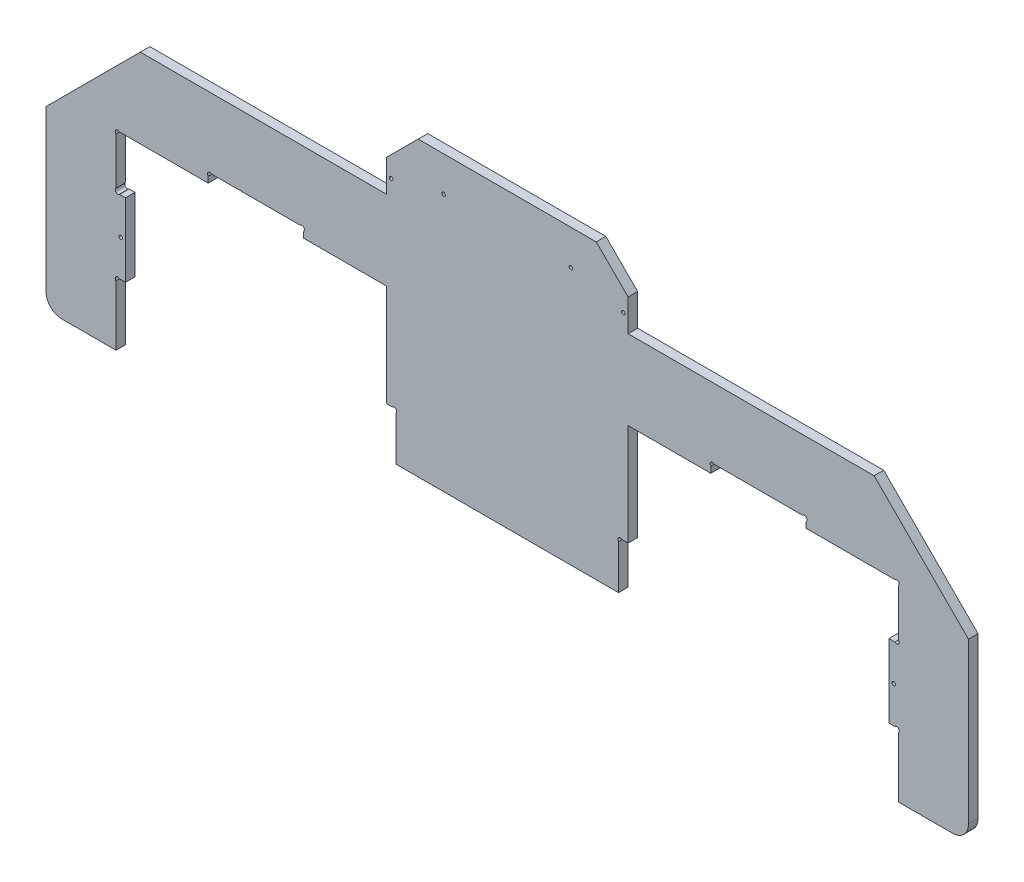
from build123d import *

# Parameters (mm, degrees)
ESQUISSE1_R        = 1.1
BOSS_EXTRU_1_DEPTH = 6


with BuildPart() as part:
    # Esquisse1 → Boss.-Extru.1 (new body)
    with BuildSketch(Plane.XY):
        with BuildLine():
            Line((56, 290), (76, 270))
            Line((76, 270), (76, 250))
            Line((76, 250), (230.710678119, 250))
            Line((230.710678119, 250), (290, 190.710678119))
            Line((290, 190.710678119), (290, 90))
            ThreePointArc((290, 90), (287.071067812, 82.928932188), (280, 80))
            Line((280, 80), (246, 80))
            Line((246, 80), (246, 117.7372583))
            ThreePointArc((246, 117.7372583), (246, 120), (243.7372583, 120))
            Line((243.7372583, 120), (240, 120))
            Line((240, 120), (240, 166))
            Line((240, 166), (243.7372583, 166))
            ThreePointArc((243.7372583, 166), (246, 166), (246, 168.2627417))
            Line((246, 168.2627417), (246, 197.7372583))
            ThreePointArc((246, 197.7372583), (246, 200), (243.7372583, 200))
            Line((243.7372583, 200), (188, 200))
            Line((188, 200), (188, 203.7372583))
            ThreePointArc((188, 203.7372583), (188, 206), (185.7372583, 206))
            Line((185.7372583, 206), (130.2627417, 206))
            ThreePointArc((130.2627417, 206), (128, 206), (128, 203.7372583))
            Line((128, 203.7372583), (128, 200))
            Line((128, 200), (76, 200))
            Line((76, 200), (76, 136))
            Line((76, 136), (72.2627417, 136))
            ThreePointArc((72.2627417, 136), (70, 136), (70, 133.7372583))
            Line((70, 133.7372583), (70, 106))
            Line((70, 106), (-70, 106))
            Line((-70, 106), (-70, 133.7372583))
            ThreePointArc((-70, 133.7372583), (-70, 136), (-72.2627417, 136))
            Line((-72.2627417, 136), (-76, 136))
            Line((-76, 136), (-76, 200))
            Line((-76, 200), (-128, 200))
            Line((-128, 200), (-128, 203.7372583))
            ThreePointArc((-128, 203.7372583), (-128, 206), (-130.2627417, 206))
            Line((-130.2627417, 206), (-185.7372583, 206))
            ThreePointArc((-185.7372583, 206), (-188, 206), (-188, 203.7372583))
            Line((-188, 203.7372583), (-188, 200))
            Line((-188, 200), (-243.7372583, 200))
            ThreePointArc((-243.7372583, 200), (-246, 200), (-246, 197.7372583))
            Line((-246, 197.7372583), (-246, 168.2627417))
            ThreePointArc((-246, 168.2627417), (-246, 166), (-243.7372583, 166))
            Line((-243.7372583, 166), (-240, 166))
            Line((-240, 166), (-240, 120))
            Line((-240, 120), (-243.7372583, 120))
            ThreePointArc((-243.7372583, 120), (-246, 120), (-246, 117.7372583))
            Line((-246, 117.7372583), (-246, 80))
            Line((-246, 80), (-280, 80))
            ThreePointArc((-280, 80), (-287.071067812, 82.928932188), (-290, 90))
            Line((-290, 90), (-290, 190.710678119))
            Line((-290, 190.710678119), (-230.710678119, 250))
            Line((-230.710678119, 250), (-76, 250))
            Line((-76, 250), (-76, 270))
            Line((-76, 270), (-56, 290))
            Line((-56, 290), (56, 290))
        make_face()
        with Locations((-73, 260)):
            Circle(ESQUISSE1_R, mode=Mode.SUBTRACT)
        with Locations((-40, 268)):
            Circle(ESQUISSE1_R, mode=Mode.SUBTRACT)
        with Locations(Location((73, 260, 0), (0, 0, 180))):
            Circle(ESQUISSE1_R, mode=Mode.SUBTRACT)
        with Locations(Location((40, 268, 0), (0, 0, 180))):
            Circle(ESQUISSE1_R, mode=Mode.SUBTRACT)
        with Locations((243, 143)):
            Circle(ESQUISSE1_R, mode=Mode.SUBTRACT)
        with Locations(Location((-243, 143, 0), (0, 0, 180))):
            Circle(ESQUISSE1_R, mode=Mode.SUBTRACT)
    extrude(amount=BOSS_EXTRU_1_DEPTH)


solid = part.part
